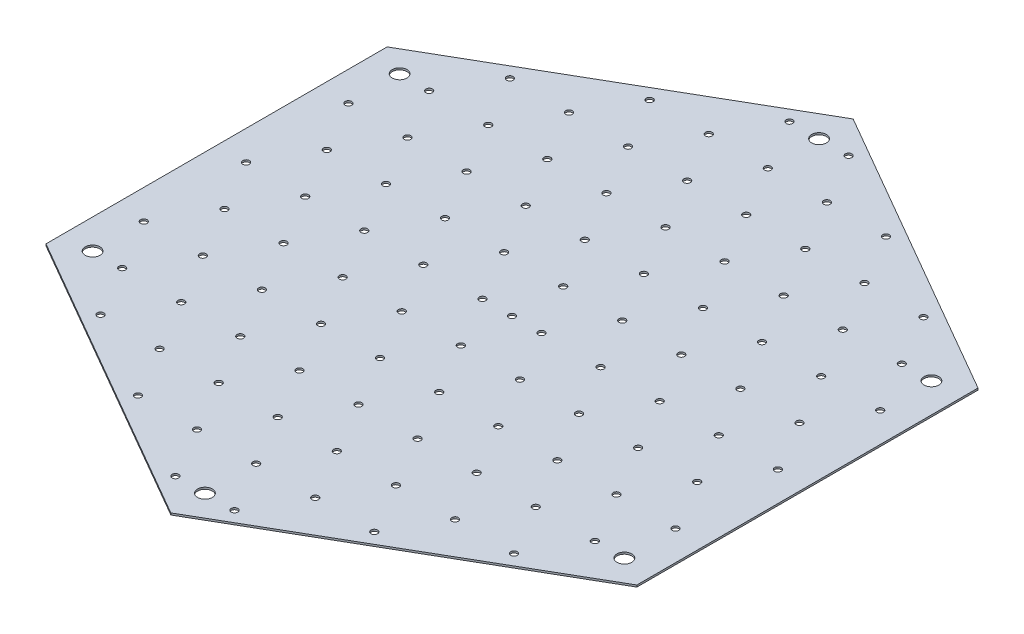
from build123d import *

# Parameters (mm, degrees)
BOSS_EXTRUDE1_DEPTH   = 0.34
SKETCH2_R             = 0.6
CUT_EXTRUDE1_DEPTH    = 83.680427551
BOSS_EXTRUDE2_DEPTH   = 0.34
BOSS_EXTRUDE3_DEPTH   = 0.34
BOSS_EXTRUDE4_DEPTH   = 0.34
SKETCH4_R             = 1.35
CUT_EXTRUDE3_DEPTH    = 83.680427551
SKETCH8_R             = 0.6
CUT_EXTRUDE4_DEPTH    = 83.680427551
SKETCH9_R             = 0.6
CUT_EXTRUDE5_DEPTH    = 83.680427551
SKETCH10_R            = 0.6
CUT_EXTRUDE6_DEPTH    = 83.680427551
SKETCH11_R            = 0.6
CUT_EXTRUDE7_DEPTH    = 83.680427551
SKETCH12_R            = 0.6
CUT_EXTRUDE8_DEPTH    = 83.680427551
SKETCH13_R            = 0.6
CUT_EXTRUDE9_DEPTH    = 83.680427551
SKETCH14_R            = 0.6
CUT_EXTRUDE10_DEPTH   = 83.680427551
SKETCH15_R            = 0.6
CUT_EXTRUDE11_DEPTH   = 83.680427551
SKETCH16_R            = 0.6
CUT_EXTRUDE12_DEPTH   = 83.680427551
SKETCH17_R            = 0.6
CUT_EXTRUDE13_DEPTH   = 83.680427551
LPATTERN3_COUNT       = 5
LPATTERN3_PITCH       = 10.8253
LPATTERN3_COL_COUNT   = 6
LPATTERN3_COL_PITCH   = 10.8253
LPATTERN4_COUNT       = 6
LPATTERN4_PITCH       = 10.8253
LPATTERN4_COL_COUNT   = 5
LPATTERN4_COL_PITCH   = 10.8253
LPATTERN5_COUNT       = 4
LPATTERN5_PITCH       = 10.8253
LPATTERN5_COL_COUNT   = 7
LPATTERN5_COL_PITCH   = 10.8253
LPATTERN6_COUNT       = 3
LPATTERN6_PITCH       = 10.8253
LPATTERN6_COL_COUNT   = 7
LPATTERN6_COL_PITCH   = 10.8253
LPATTERN7_COUNT       = 6
LPATTERN7_PITCH       = 10.8253
LPATTERN8_COUNT       = 5
LPATTERN8_PITCH       = 10.8253
LPATTERN9_COUNT       = 5
LPATTERN9_PITCH       = 10.8253
LPATTERN9_COL_COUNT   = 2
LPATTERN9_COL_PITCH   = 10.8253
LPATTERN10_COUNT      = 4
LPATTERN10_PITCH      = 10.8253
LPATTERN10_COL_COUNT  = 3
LPATTERN10_COL_PITCH  = 10.8253
LPATTERN11_COUNT      = 4
LPATTERN11_PITCH      = 10.8253
LPATTERN11_COL_COUNT  = 3
LPATTERN11_COL_PITCH  = 10.8253
LPATTERN12_COUNT      = 5
LPATTERN12_PITCH      = 10.8253
LPATTERN13_COUNT      = 6
LPATTERN13_PITCH      = 10.8253
LPATTERN14_COUNT      = 6
LPATTERN14_PITCH      = 10.8253
LPATTERN14_COUNT_DIR2 = 5
LPATTERN14_PITCH_DIR2 = 10.8253
LPATTERN15_COUNT      = 7
LPATTERN15_PITCH      = 10.8253
LPATTERN15_COUNT_DIR2 = 4
LPATTERN15_PITCH_DIR2 = 10.8253
LPATTERN16_COUNT      = 7
LPATTERN16_PITCH      = 10.8253
LPATTERN16_COUNT_DIR2 = 3
LPATTERN16_PITCH_DIR2 = 10.8253
LPATTERN17_COUNT      = 6
LPATTERN17_PITCH      = 10.8253
LPATTERN18_COUNT      = 5
LPATTERN18_PITCH      = 10.8253
LPATTERN19_COUNT      = 4
LPATTERN19_PITCH      = 10.8253
LPATTERN20_COUNT      = 3
LPATTERN20_PITCH      = 10.8253


with BuildPart() as part:
    # Sketch1 → Boss-Extrude1 (new body)
    with BuildSketch(Plane(origin=(0, 0, 0), x_dir=(1, 0, 0), z_dir=(0, 1, 0))):
        Polygon((0, 62.5), (-54.126587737, 31.25), (-54.126587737, -31.25), (0, -62.5), (54.126587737, -31.25), (54.126587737, 31.25), align=None)
    extrude(amount=BOSS_EXTRUDE1_DEPTH)

    # Sketch2 → Cut-Extrude1 (cut, through all)
    with BuildSketch(Plane(origin=(0, 0.34, 0), x_dir=(1, 0, 0), z_dir=(0, 1, 0))):
        with Locations(Location((0, 0, 0), (0, 0, 270))):
            Circle(SKETCH2_R)
    extrude(amount=-CUT_EXTRUDE1_DEPTH, mode=Mode.SUBTRACT)

    # Sketch5 → Boss-Extrude2 (add)
    with BuildSketch(Plane(origin=(0, 0.34, 0), x_dir=(1, 0, 0), z_dir=(0, 1, 0))):
        Polygon((-54.126587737, 26.862137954), (3.8, 60.306068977), (0, 62.5), (-54.126587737, 31.25), align=None)
    extrude(amount=-BOSS_EXTRUDE2_DEPTH)

    # Sketch6 → Boss-Extrude3 (add)
    with BuildSketch(Plane(origin=(0, 0.34, 0), x_dir=(1, 0, 0), z_dir=(0, 1, 0))):
        Polygon((54.126587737, 31.25), (54.126587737, 26.862137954), (-3.8, 60.306068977), (0, 62.5), align=None)
    extrude(amount=-BOSS_EXTRUDE3_DEPTH)

    # Sketch7 → Boss-Extrude4 (add)
    with BuildSketch(Plane(origin=(0, 0.34, 0), x_dir=(1, 0, 0), z_dir=(0, 1, 0))):
        Polygon((-54.126587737, -31.25), (-54.126587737, -26.862137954), (0, -58.112137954), (54.126587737, -26.862137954), (54.126587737, -31.25), (0, -62.5), align=None)
    extrude(amount=-BOSS_EXTRUDE4_DEPTH)

    # Sketch4 → Cut-Extrude3 (cut, through all)
    with BuildSketch(Plane(origin=(0, 0.34, 0), x_dir=(1, 0, 0), z_dir=(0, 1, 0))):
        with Locations(Location((0, 56.253070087, 0), (0, 0, 270))):
            Circle(SKETCH4_R)
        with Locations(Location((-48.713928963, 28.125, 0), (0, 0, 270))):
            Circle(SKETCH4_R)
        with Locations(Location((-48.716587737, -28.126535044, 0), (0, 0, 270))):
            Circle(SKETCH4_R)
        with Locations(Location((0, -56.253070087, 0), (0, 0, 270))):
            Circle(SKETCH4_R)
        with Locations(Location((48.716587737, -28.126535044, 0), (0, 0, 270))):
            Circle(SKETCH4_R)
        with Locations(Location((48.716587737, 28.126535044, 0), (0, 0, 270))):
            Circle(SKETCH4_R)
    extrude(amount=-CUT_EXTRUDE3_DEPTH, mode=Mode.SUBTRACT)

    # Sketch8 → Cut-Extrude4 (cut, through all)
    with BuildSketch(Plane(origin=(0, 0.34, 0), x_dir=(1, 0, 0), z_dir=(0, 1, 0))):
        with Locations(Location((5.41265, 0, 0), (0, 0, 270))):
            Circle(SKETCH8_R)
    cut_extrude4 = extrude(amount=-CUT_EXTRUDE4_DEPTH, mode=Mode.SUBTRACT)

    # Sketch9 → Cut-Extrude5 (cut, through all)
    with BuildSketch(Plane(origin=(0, 0.34, 0), x_dir=(1, 0, 0), z_dir=(0, 1, 0))):
        with Locations(Location((16.23795, 0, 0), (0, 0, 270))):
            Circle(SKETCH9_R)
    cut_extrude5 = extrude(amount=-CUT_EXTRUDE5_DEPTH, mode=Mode.SUBTRACT)

    # Sketch10 → Cut-Extrude6 (cut, through all)
    with BuildSketch(Plane(origin=(0, 0.34, 0), x_dir=(1, 0, 0), z_dir=(0, 1, 0))):
        with Locations(Location((27.06325, 0, 0), (0, 0, 270))):
            Circle(SKETCH10_R)
    cut_extrude6 = extrude(amount=-CUT_EXTRUDE6_DEPTH, mode=Mode.SUBTRACT)

    # Sketch11 → Cut-Extrude7 (cut, through all)
    with BuildSketch(Plane(origin=(0, 0.34, 0), x_dir=(1, 0, 0), z_dir=(0, 1, 0))):
        with Locations(Location((37.88855, 0, 0), (0, 0, 270))):
            Circle(SKETCH11_R)
    cut_extrude7 = extrude(amount=-CUT_EXTRUDE7_DEPTH, mode=Mode.SUBTRACT)

    # Sketch12 → Cut-Extrude8 (cut, through all)
    with BuildSketch(Plane(origin=(0, 0.34, 0), x_dir=(1, 0, 0), z_dir=(0, 1, 0))):
        with Locations(Location((48.71385, 0, 0), (0, 0, 270))):
            Circle(SKETCH12_R)
    cut_extrude8 = extrude(amount=-CUT_EXTRUDE8_DEPTH, mode=Mode.SUBTRACT)

    # Sketch13 → Cut-Extrude9 (cut, through all)
    with BuildSketch(Plane(origin=(0, 0.34, 0), x_dir=(1, 0, 0), z_dir=(0, 1, 0))):
        with Locations(Location((-5.41265, 0, 0), (0, 0, 270))):
            Circle(SKETCH13_R)
    cut_extrude9 = extrude(amount=-CUT_EXTRUDE9_DEPTH, mode=Mode.SUBTRACT)

    # Sketch14 → Cut-Extrude10 (cut, through all)
    with BuildSketch(Plane(origin=(0, 0.34, 0), x_dir=(1, 0, 0), z_dir=(0, 1, 0))):
        with Locations(Location((-16.23795, 0, 0), (0, 0, 270))):
            Circle(SKETCH14_R)
    cut_extrude10 = extrude(amount=-CUT_EXTRUDE10_DEPTH, mode=Mode.SUBTRACT)

    # Sketch15 → Cut-Extrude11 (cut, through all)
    with BuildSketch(Plane(origin=(0, 0.34, 0), x_dir=(1, 0, 0), z_dir=(0, 1, 0))):
        with Locations(Location((-27.06325, 0, 0), (0, 0, 270))):
            Circle(SKETCH15_R)
    cut_extrude11 = extrude(amount=-CUT_EXTRUDE11_DEPTH, mode=Mode.SUBTRACT)

    # Sketch16 → Cut-Extrude12 (cut, through all)
    with BuildSketch(Plane(origin=(0, 0.34, 0), x_dir=(1, 0, 0), z_dir=(0, 1, 0))):
        with Locations(Location((-37.88855, 0, 0), (0, 0, 270))):
            Circle(SKETCH16_R)
    cut_extrude12 = extrude(amount=-CUT_EXTRUDE12_DEPTH, mode=Mode.SUBTRACT)

    # Sketch17 → Cut-Extrude13 (cut, through all)
    with BuildSketch(Plane(origin=(0, 0.34, 0), x_dir=(1, 0, 0), z_dir=(0, 1, 0))):
        with Locations(Location((-48.71385, 0, 0), (0, 0, 270))):
            Circle(SKETCH17_R)
    cut_extrude13 = extrude(amount=-CUT_EXTRUDE13_DEPTH, mode=Mode.SUBTRACT)

    # LPattern3: Cut-Extrude4 ×5
    with Locations(*[Vector(0.4999999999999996, 0, 0.8660254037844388) * (i * LPATTERN3_PITCH) for i in range(1, LPATTERN3_COUNT)]):
        add(cut_extrude4, mode=Mode.SUBTRACT)

    # LPattern3 col: Cut-Extrude4 ×6
    with Locations(*[Vector(-0.4999999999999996, 0, -0.8660254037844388) * (i * LPATTERN3_COL_PITCH) for i in range(1, LPATTERN3_COL_COUNT)]):
        add(cut_extrude4, mode=Mode.SUBTRACT)

    # LPattern4: Cut-Extrude5 ×6
    with Locations(*[Vector(-0.4999999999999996, 0, -0.8660254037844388) * (i * LPATTERN4_PITCH) for i in range(1, LPATTERN4_COUNT)]):
        add(cut_extrude5, mode=Mode.SUBTRACT)

    # LPattern4 col: Cut-Extrude5 ×5
    with Locations(*[Vector(0.4999999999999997, 0, 0.8660254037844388) * (i * LPATTERN4_COL_PITCH) for i in range(1, LPATTERN4_COL_COUNT)]):
        add(cut_extrude5, mode=Mode.SUBTRACT)

    # LPattern5: Cut-Extrude6 ×4
    with Locations(*[Vector(0.4999999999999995, 0, 0.8660254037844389) * (i * LPATTERN5_PITCH) for i in range(1, LPATTERN5_COUNT)]):
        add(cut_extrude6, mode=Mode.SUBTRACT)

    # LPattern5 col: Cut-Extrude6 ×7
    with Locations(*[Vector(-0.4999999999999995, 0, -0.8660254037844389) * (i * LPATTERN5_COL_PITCH) for i in range(1, LPATTERN5_COL_COUNT)]):
        add(cut_extrude6, mode=Mode.SUBTRACT)

    # LPattern6: Cut-Extrude7 ×3
    with Locations(*[Vector(0.4999999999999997, 0, 0.8660254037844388) * (i * LPATTERN6_PITCH) for i in range(1, LPATTERN6_COUNT)]):
        add(cut_extrude7, mode=Mode.SUBTRACT)

    # LPattern6 col: Cut-Extrude7 ×7
    with Locations(*[Vector(-0.4999999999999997, 0, -0.8660254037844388) * (i * LPATTERN6_COL_PITCH) for i in range(1, LPATTERN6_COL_COUNT)]):
        add(cut_extrude7, mode=Mode.SUBTRACT)

    # LPattern7: Cut-Extrude8 ×6
    with Locations(*[Vector(-0.4999999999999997, 0, -0.8660254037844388) * (i * LPATTERN7_PITCH) for i in range(1, LPATTERN7_COUNT)]):
        add(cut_extrude8, mode=Mode.SUBTRACT)

    # LPattern8: Cut-Extrude9 ×5
    with Locations(*[Vector(-0.4999999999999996, 0, 0.8660254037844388) * (i * LPATTERN8_PITCH) for i in range(1, LPATTERN8_COUNT)]):
        add(cut_extrude9, mode=Mode.SUBTRACT)

    # LPattern9: Cut-Extrude10 ×5
    with Locations(*[Vector(-0.4999999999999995, 0, 0.8660254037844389) * (i * LPATTERN9_PITCH) for i in range(1, LPATTERN9_COUNT)]):
        add(cut_extrude10, mode=Mode.SUBTRACT)

    # LPattern9 col: Cut-Extrude10 ×2
    with Locations(*[Vector(0.4999999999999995, 0, -0.8660254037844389) * (i * LPATTERN9_COL_PITCH) for i in range(1, LPATTERN9_COL_COUNT)]):
        add(cut_extrude10, mode=Mode.SUBTRACT)

    # LPattern10: Cut-Extrude11 ×4
    with Locations(*[Vector(-0.4999999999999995, 0, 0.8660254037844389) * (i * LPATTERN10_PITCH) for i in range(1, LPATTERN10_COUNT)]):
        add(cut_extrude11, mode=Mode.SUBTRACT)

    # LPattern10 col: Cut-Extrude11 ×3
    with Locations(*[Vector(0.4999999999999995, 0, -0.8660254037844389) * (i * LPATTERN10_COL_PITCH) for i in range(1, LPATTERN10_COL_COUNT)]):
        add(cut_extrude11, mode=Mode.SUBTRACT)

    # LPattern11: Cut-Extrude12 ×4
    with Locations(*[Vector(0.4999999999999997, 0, -0.8660254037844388) * (i * LPATTERN11_PITCH) for i in range(1, LPATTERN11_COUNT)]):
        add(cut_extrude12, mode=Mode.SUBTRACT)

    # LPattern11 col: Cut-Extrude12 ×3
    with Locations(*[Vector(-0.4999999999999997, 0, 0.8660254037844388) * (i * LPATTERN11_COL_PITCH) for i in range(1, LPATTERN11_COL_COUNT)]):
        add(cut_extrude12, mode=Mode.SUBTRACT)

    # LPattern12: Cut-Extrude13 ×5
    with Locations(*[Vector(0.4999999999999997, 0, -0.8660254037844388) * (i * LPATTERN12_PITCH) for i in range(1, LPATTERN12_COUNT)]):
        add(cut_extrude13, mode=Mode.SUBTRACT)

    # LPattern13: Cut-Extrude9 ×6
    with Locations(*[Vector(0.4999999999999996, 0, 0.8660254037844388) * (i * LPATTERN13_PITCH) for i in range(1, LPATTERN13_COUNT)]):
        add(cut_extrude9, mode=Mode.SUBTRACT)

    # LPattern14: Cut-Extrude10 6 × 5
    with Locations(*[Vector(0.4999999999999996, 0, 0.8660254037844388) * (i * LPATTERN14_PITCH) + Vector(-0.4999999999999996, 0, -0.8660254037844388) * (j * LPATTERN14_PITCH_DIR2) for i in range(LPATTERN14_COUNT) for j in range(LPATTERN14_COUNT_DIR2) if (i, j) != (0, 0)]):
        add(cut_extrude10, mode=Mode.SUBTRACT)

    # LPattern15: Cut-Extrude11 7 × 4
    with Locations(*[Vector(0.4999999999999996, 0, 0.8660254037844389) * (i * LPATTERN15_PITCH) + Vector(-0.4999999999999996, 0, -0.8660254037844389) * (j * LPATTERN15_PITCH_DIR2) for i in range(LPATTERN15_COUNT) for j in range(LPATTERN15_COUNT_DIR2) if (i, j) != (0, 0)]):
        add(cut_extrude11, mode=Mode.SUBTRACT)

    # LPattern16: Cut-Extrude12 7 × 3
    with Locations(*[Vector(0.4999999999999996, 0, 0.8660254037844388) * (i * LPATTERN16_PITCH) + Vector(-0.4999999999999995, 0, -0.8660254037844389) * (j * LPATTERN16_PITCH_DIR2) for i in range(LPATTERN16_COUNT) for j in range(LPATTERN16_COUNT_DIR2) if (i, j) != (0, 0)]):
        add(cut_extrude12, mode=Mode.SUBTRACT)

    # LPattern17: Cut-Extrude13 ×6
    with Locations(*[Vector(0.49999999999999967, 0, 0.8660254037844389) * (i * LPATTERN17_PITCH) for i in range(1, LPATTERN17_COUNT)]):
        add(cut_extrude13, mode=Mode.SUBTRACT)

    # LPattern18: Cut-Extrude5 ×5
    with Locations(*[Vector(0.4999999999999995, 0, -0.8660254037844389) * (i * LPATTERN18_PITCH) for i in range(1, LPATTERN18_COUNT)]):
        add(cut_extrude5, mode=Mode.SUBTRACT)

    # LPattern19: Cut-Extrude6 ×4
    with Locations(*[Vector(0.4999999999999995, 0, -0.866025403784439) * (i * LPATTERN19_PITCH) for i in range(1, LPATTERN19_COUNT)]):
        add(cut_extrude6, mode=Mode.SUBTRACT)

    # LPattern20: Cut-Extrude7 ×3
    with Locations(*[Vector(0.4999999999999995, 0, -0.8660254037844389) * (i * LPATTERN20_PITCH) for i in range(1, LPATTERN20_COUNT)]):
        add(cut_extrude7, mode=Mode.SUBTRACT)


solid = part.part
